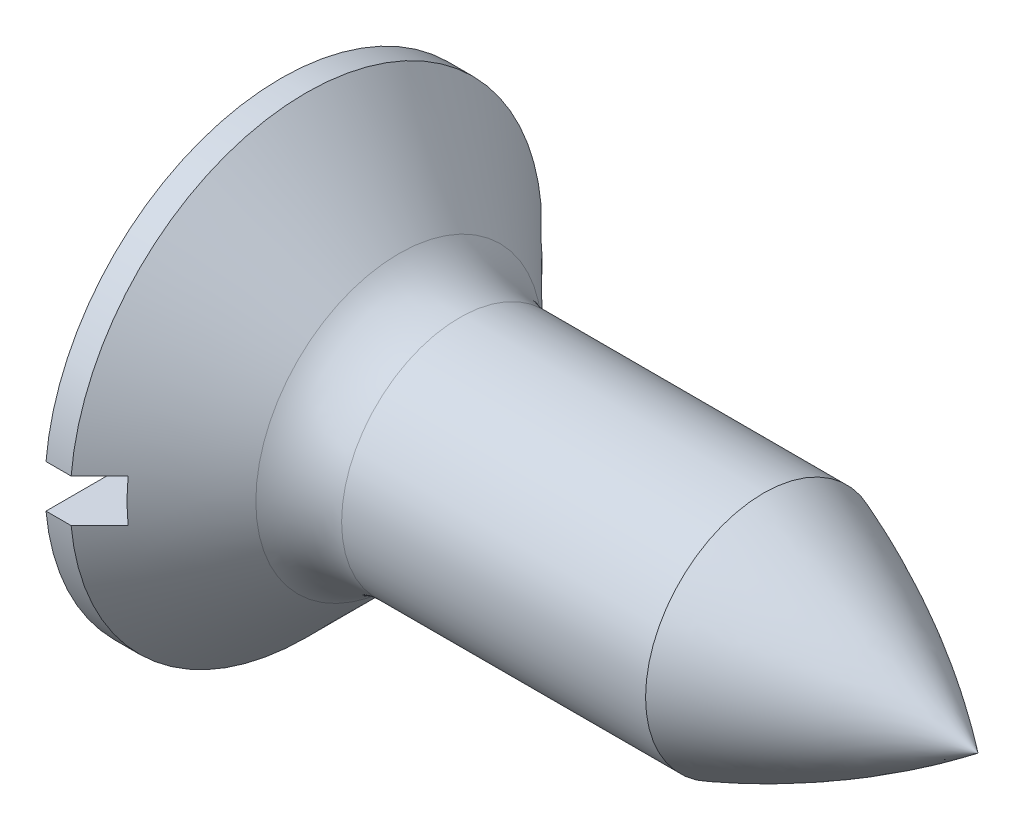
ISO-10303-21;
HEADER;
FILE_DESCRIPTION(('STEP AP214'),'2;1');
FILE_NAME('part.step','',(''),(''),'','','');
FILE_SCHEMA(('AUTOMOTIVE_DESIGN { 1 0 10303 214 1 1 1 1 }'));
ENDSEC;
DATA;
#1=APPLICATION_CONTEXT('core data for automotive mechanical design processes');
#2=APPLICATION_PROTOCOL_DEFINITION('international standard','automotive_design',2000,#1);
#3=PRODUCT_CONTEXT('',#1,'mechanical');
#4=PRODUCT('Part','Part','',(#3));
#5=PRODUCT_RELATED_PRODUCT_CATEGORY('part','',(#4));
#6=PRODUCT_DEFINITION_FORMATION('','',#4);
#7=PRODUCT_DEFINITION_CONTEXT('part definition',#1,'design');
#8=PRODUCT_DEFINITION('design','',#6,#7);
#9=PRODUCT_DEFINITION_SHAPE('','',#8);
#10=(LENGTH_UNIT() NAMED_UNIT(*) SI_UNIT(.MILLI.,.METRE.));
#11=(NAMED_UNIT(*) PLANE_ANGLE_UNIT() SI_UNIT($,.RADIAN.));
#12=(NAMED_UNIT(*) SI_UNIT($,.STERADIAN.) SOLID_ANGLE_UNIT());
#13=UNCERTAINTY_MEASURE_WITH_UNIT(LENGTH_MEASURE(1.E-05),#10,'distance_accuracy_value','');
#14=(GEOMETRIC_REPRESENTATION_CONTEXT(3) GLOBAL_UNCERTAINTY_ASSIGNED_CONTEXT((#13)) GLOBAL_UNIT_ASSIGNED_CONTEXT((#10,
#11,#12)) REPRESENTATION_CONTEXT('',''));
#15=CARTESIAN_POINT('',(0.,0.,0.));
#16=DIRECTION('',(0.,0.,1.));
#17=DIRECTION('',(1.,0.,0.));
#18=AXIS2_PLACEMENT_3D('',#15,#16,#17);
#19=CARTESIAN_POINT('',(-9.69447010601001,0.,0.));
#20=DIRECTION('',(-1.,0.,0.));
#21=DIRECTION('',(0.,0.,1.));
#22=AXIS2_PLACEMENT_3D('',#19,#20,#21);
#23=CYLINDRICAL_SURFACE('',#22,1.1);
#24=CARTESIAN_POINT('',(1.66568542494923,0.,0.));
#25=DIRECTION('',(-1.,0.,0.));
#26=DIRECTION('',(0.,0.,1.));
#27=AXIS2_PLACEMENT_3D('',#24,#25,#26);
#28=CIRCLE('',#27,1.1);
#29=CARTESIAN_POINT('',(1.66568542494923,0.,1.1));
#30=VERTEX_POINT('',#29);
#31=EDGE_CURVE('E143',#30,#30,#28,.T.);
#32=ORIENTED_EDGE('',*,*,#31,.F.);
#33=EDGE_LOOP('',(#32));
#34=FACE_BOUND('',#33,.T.);
#35=CARTESIAN_POINT('',(4.5,0.,0.));
#36=DIRECTION('',(1.,0.,0.));
#37=DIRECTION('',(0.,1.,0.));
#38=AXIS2_PLACEMENT_3D('',#35,#36,#37);
#39=CIRCLE('',#38,1.1);
#40=CARTESIAN_POINT('',(4.5,1.09999999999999,0.));
#41=VERTEX_POINT('',#40);
#42=EDGE_CURVE('E194',#41,#41,#39,.T.);
#43=ORIENTED_EDGE('',*,*,#42,.F.);
#44=EDGE_LOOP('',(#43));
#45=FACE_BOUND('',#44,.T.);
#46=ADVANCED_FACE('F37',(#34,#45),#23,.T.);
#47=CARTESIAN_POINT('',(0.,2.2,0.));
#48=DIRECTION('',(1.,0.,0.));
#49=DIRECTION('',(0.,0.,-1.));
#50=AXIS2_PLACEMENT_3D('',#47,#48,#49);
#51=PLANE('',#50);
#52=CARTESIAN_POINT('',(0.,0.,0.));
#53=DIRECTION('',(-1.,0.,0.));
#54=DIRECTION('',(0.,0.,1.));
#55=AXIS2_PLACEMENT_3D('',#52,#53,#54);
#56=CIRCLE('',#55,2.2);
#57=CARTESIAN_POINT('',(0.,0.2,2.19089023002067));
#58=VERTEX_POINT('',#57);
#59=CARTESIAN_POINT('',(0.,0.2,-2.19089023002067));
#60=VERTEX_POINT('',#59);
#61=EDGE_CURVE('E177',#58,#60,#56,.T.);
#62=ORIENTED_EDGE('',*,*,#61,.T.);
#63=DIRECTION('',(0.,0.,1.));
#64=VECTOR('',#63,1.);
#65=CARTESIAN_POINT('',(0.,0.2,-2.20000000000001));
#66=LINE('',#65,#64);
#67=EDGE_CURVE('E168',#60,#58,#66,.T.);
#68=ORIENTED_EDGE('',*,*,#67,.T.);
#69=EDGE_LOOP('',(#62,#68));
#70=FACE_BOUND('',#69,.T.);
#71=ADVANCED_FACE('F110',(#70),#51,.F.);
#72=CARTESIAN_POINT('',(-9.69447010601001,0.,0.));
#73=DIRECTION('',(-1.,0.,0.));
#74=DIRECTION('',(0.,0.,1.));
#75=AXIS2_PLACEMENT_3D('',#72,#73,#74);
#76=CYLINDRICAL_SURFACE('',#75,2.2);
#77=CARTESIAN_POINT('',(0.234314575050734,0.,0.));
#78=DIRECTION('',(-1.,0.,0.));
#79=DIRECTION('',(0.,0.,1.));
#80=AXIS2_PLACEMENT_3D('',#77,#78,#79);
#81=CIRCLE('',#80,2.20000000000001);
#82=CARTESIAN_POINT('',(0.234314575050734,-0.2,-2.19089023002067));
#83=VERTEX_POINT('',#82);
#84=CARTESIAN_POINT('',(0.234314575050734,-0.2,2.19089023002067));
#85=VERTEX_POINT('',#84);
#86=EDGE_CURVE('E152',#83,#85,#81,.T.);
#87=ORIENTED_EDGE('',*,*,#86,.T.);
#88=DIRECTION('',(-1.,0.,0.));
#89=VECTOR('',#88,1.);
#90=CARTESIAN_POINT('',(-9.69447010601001,-0.200000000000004,2.19089023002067));
#91=LINE('',#90,#89);
#92=CARTESIAN_POINT('',(0.,-0.2,2.19089023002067));
#93=VERTEX_POINT('',#92);
#94=EDGE_CURVE('E59',#85,#93,#91,.T.);
#95=ORIENTED_EDGE('',*,*,#94,.T.);
#96=CARTESIAN_POINT('',(0.,-0.2,-2.19089023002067));
#97=VERTEX_POINT('',#96);
#98=EDGE_CURVE('E162',#97,#93,#56,.T.);
#99=ORIENTED_EDGE('',*,*,#98,.F.);
#100=DIRECTION('',(-1.,0.,0.));
#101=VECTOR('',#100,1.);
#102=CARTESIAN_POINT('',(-9.69447010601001,-0.200000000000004,-2.19089023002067));
#103=LINE('',#102,#101);
#104=EDGE_CURVE('E155',#97,#83,#103,.F.);
#105=ORIENTED_EDGE('',*,*,#104,.T.);
#106=EDGE_LOOP('',(#87,#95,#99,#105));
#107=FACE_BOUND('',#106,.T.);
#108=ADVANCED_FACE('F115',(#107),#76,.T.);
#109=CARTESIAN_POINT('',(1.66568542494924,0.,0.));
#110=DIRECTION('',(-1.,0.,0.));
#111=DIRECTION('',(0.,0.,1.));
#112=AXIS2_PLACEMENT_3D('',#109,#110,#111);
#113=TOROIDAL_SURFACE('',#112,1.9,0.800000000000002);
#114=CARTESIAN_POINT('',(1.1,0.,0.));
#115=DIRECTION('',(-1.,0.,0.));
#116=DIRECTION('',(0.,0.,1.));
#117=AXIS2_PLACEMENT_3D('',#114,#115,#116);
#118=CIRCLE('',#117,1.33431457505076);
#119=CARTESIAN_POINT('',(1.1,0.,1.33431457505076));
#120=VERTEX_POINT('',#119);
#121=EDGE_CURVE('E173',#120,#120,#118,.T.);
#122=ORIENTED_EDGE('',*,*,#121,.F.);
#123=EDGE_LOOP('',(#122));
#124=FACE_BOUND('',#123,.T.);
#125=ORIENTED_EDGE('',*,*,#31,.T.);
#126=EDGE_LOOP('',(#125));
#127=FACE_BOUND('',#126,.T.);
#128=ADVANCED_FACE('F39',(#124,#127),#113,.F.);
#129=ORIENTED_EDGE('',*,*,#98,.T.);
#130=DIRECTION('',(0.,0.,1.));
#131=VECTOR('',#130,1.);
#132=CARTESIAN_POINT('',(0.,-0.2,-2.20000000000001));
#133=LINE('',#132,#131);
#134=EDGE_CURVE('E191',#97,#93,#133,.T.);
#135=ORIENTED_EDGE('',*,*,#134,.F.);
#136=EDGE_LOOP('',(#129,#135));
#137=FACE_BOUND('',#136,.T.);
#138=ADVANCED_FACE('F118',(#137),#51,.F.);
#139=CARTESIAN_POINT('',(0.234314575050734,0.2,2.19089023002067));
#140=VERTEX_POINT('',#139);
#141=CARTESIAN_POINT('',(0.234314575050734,0.2,-2.19089023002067));
#142=VERTEX_POINT('',#141);
#143=EDGE_CURVE('E176',#140,#142,#81,.T.);
#144=ORIENTED_EDGE('',*,*,#143,.T.);
#145=DIRECTION('',(-1.,0.,0.));
#146=VECTOR('',#145,1.);
#147=CARTESIAN_POINT('',(-9.69447010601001,0.200000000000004,-2.19089023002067));
#148=LINE('',#147,#146);
#149=EDGE_CURVE('E163',#142,#60,#148,.T.);
#150=ORIENTED_EDGE('',*,*,#149,.T.);
#151=ORIENTED_EDGE('',*,*,#61,.F.);
#152=DIRECTION('',(-1.,0.,0.));
#153=VECTOR('',#152,1.);
#154=CARTESIAN_POINT('',(-9.69447010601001,0.200000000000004,2.19089023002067));
#155=LINE('',#154,#153);
#156=EDGE_CURVE('E166',#58,#140,#155,.F.);
#157=ORIENTED_EDGE('',*,*,#156,.T.);
#158=EDGE_LOOP('',(#144,#150,#151,#157));
#159=FACE_BOUND('',#158,.T.);
#160=ADVANCED_FACE('F123',(#159),#76,.T.);
#161=CARTESIAN_POINT('',(1.1,0.,0.));
#162=DIRECTION('',(-1.,0.,0.));
#163=DIRECTION('',(0.,0.,1.));
#164=AXIS2_PLACEMENT_3D('',#161,#162,#163);
#165=CONICAL_SURFACE('',#164,1.33431457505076,0.785398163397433);
#166=CARTESIAN_POINT('',(0.500000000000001,0.,0.));
#167=DIRECTION('',(1.,0.,0.));
#168=DIRECTION('',(0.,0.,-1.));
#169=AXIS2_PLACEMENT_3D('',#166,#167,#168);
#170=CIRCLE('',#169,1.93431457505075);
#171=CARTESIAN_POINT('',(0.5,-0.2,-1.92394721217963));
#172=VERTEX_POINT('',#171);
#173=CARTESIAN_POINT('',(0.500000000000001,0.2,-1.92394721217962));
#174=VERTEX_POINT('',#173);
#175=EDGE_CURVE('E52',#172,#174,#170,.T.);
#176=ORIENTED_EDGE('',*,*,#175,.T.);
#177=CARTESIAN_POINT('',(-2.41069391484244,0.200000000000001,4.84087877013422));
#178=CARTESIAN_POINT('',(-2.24297367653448,0.200000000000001,4.67301429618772));
#179=CARTESIAN_POINT('',(-2.07525978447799,0.200000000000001,4.50514348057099));
#180=CARTESIAN_POINT('',(-1.73985244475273,0.200000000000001,4.16938038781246));
#181=CARTESIAN_POINT('',(-1.57215899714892,0.200000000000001,4.00148811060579));
#182=CARTESIAN_POINT('',(-1.23678930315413,0.2,3.66566230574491));
#183=CARTESIAN_POINT('',(-1.0691130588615,0.2,3.49772877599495));
#184=CARTESIAN_POINT('',(-0.733805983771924,0.2,3.16181740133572));
#185=CARTESIAN_POINT('',(-0.566175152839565,0.2,2.99383955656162));
#186=CARTESIAN_POINT('',(-0.232103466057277,0.2,2.6589335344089));
#187=CARTESIAN_POINT('',(-0.065662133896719,0.2,2.49200583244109));
#188=CARTESIAN_POINT('',(0.267092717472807,0.2,2.1580202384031));
#189=CARTESIAN_POINT('',(0.433406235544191,0.2,1.99096234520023));
#190=CARTESIAN_POINT('',(0.765782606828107,0.2,1.65661111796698));
#191=CARTESIAN_POINT('',(0.931845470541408,0.199999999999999,1.48931779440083));
#192=CARTESIAN_POINT('',(1.1804372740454,0.199999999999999,1.23788329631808));
#193=CARTESIAN_POINT('',(1.26321686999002,0.199999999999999,1.15398997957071));
#194=CARTESIAN_POINT('',(1.42846267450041,0.199999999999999,0.985895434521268));
#195=CARTESIAN_POINT('',(1.51092888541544,0.199999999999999,0.901694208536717));
#196=CARTESIAN_POINT('',(1.61557294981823,0.199999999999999,0.793956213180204));
#197=CARTESIAN_POINT('',(1.63807561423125,0.199999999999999,0.770735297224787));
#198=CARTESIAN_POINT('',(1.68300748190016,0.199999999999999,0.724222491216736));
#199=CARTESIAN_POINT('',(1.70543668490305,0.199999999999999,0.700930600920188));
#200=CARTESIAN_POINT('',(1.77263186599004,0.199999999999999,0.630875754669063));
#201=CARTESIAN_POINT('',(1.81726039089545,0.199999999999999,0.583979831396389));
#202=CARTESIAN_POINT('',(1.89116538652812,0.199999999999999,0.505104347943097));
#203=CARTESIAN_POINT('',(1.92064383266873,0.199999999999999,0.473314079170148));
#204=CARTESIAN_POINT('',(1.9789835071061,0.199999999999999,0.409275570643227));
#205=CARTESIAN_POINT('',(2.00784580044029,0.199999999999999,0.377028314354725));
#206=CARTESIAN_POINT('',(2.05455425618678,0.199999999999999,0.323001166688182));
#207=CARTESIAN_POINT('',(2.0727247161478,0.199999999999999,0.301502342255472));
#208=CARTESIAN_POINT('',(2.10835670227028,0.199999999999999,0.257713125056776));
#209=CARTESIAN_POINT('',(2.12581381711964,0.199999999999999,0.235419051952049));
#210=CARTESIAN_POINT('',(2.15091417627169,0.199999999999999,0.200941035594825));
#211=CARTESIAN_POINT('',(2.15915158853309,0.199999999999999,0.189193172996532));
#212=CARTESIAN_POINT('',(2.17500740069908,0.199999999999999,0.165290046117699));
#213=CARTESIAN_POINT('',(2.18262612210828,0.199999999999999,0.153134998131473));
#214=CARTESIAN_POINT('',(2.19687665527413,0.199999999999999,0.128369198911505));
#215=CARTESIAN_POINT('',(2.20351543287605,0.199999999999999,0.115762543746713));
#216=CARTESIAN_POINT('',(2.21533974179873,0.199999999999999,0.0898989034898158));
#217=CARTESIAN_POINT('',(2.22052901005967,0.199999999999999,0.0766436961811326));
#218=CARTESIAN_POINT('',(2.22857314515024,0.199999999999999,0.0498599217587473));
#219=CARTESIAN_POINT('',(2.23149676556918,0.199999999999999,0.0363533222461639));
#220=CARTESIAN_POINT('',(2.23456247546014,0.199999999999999,0.00906199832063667));
#221=CARTESIAN_POINT('',(2.23471669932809,0.199999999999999,-0.00472124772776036));
#222=CARTESIAN_POINT('',(2.23223406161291,0.199999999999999,-0.0319600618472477));
#223=CARTESIAN_POINT('',(2.2296076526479,0.199999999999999,-0.0454166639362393));
#224=CARTESIAN_POINT('',(2.22220860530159,0.199999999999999,-0.0717712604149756));
#225=CARTESIAN_POINT('',(2.21742331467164,0.199999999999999,-0.0846654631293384));
#226=CARTESIAN_POINT('',(2.2040995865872,0.199999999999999,-0.115155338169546));
#227=CARTESIAN_POINT('',(2.19483042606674,0.199999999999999,-0.132419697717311));
#228=CARTESIAN_POINT('',(2.17472772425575,0.199999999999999,-0.166029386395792));
#229=CARTESIAN_POINT('',(2.16388972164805,0.199999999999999,-0.182371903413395));
#230=CARTESIAN_POINT('',(2.1412388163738,0.199999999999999,-0.214532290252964));
#231=CARTESIAN_POINT('',(2.12941957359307,0.199999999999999,-0.230345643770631));
#232=CARTESIAN_POINT('',(2.10523785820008,0.199999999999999,-0.261508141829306));
#233=CARTESIAN_POINT('',(2.09287621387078,0.199999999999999,-0.276857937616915));
#234=CARTESIAN_POINT('',(2.0505986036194,0.199999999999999,-0.328119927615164));
#235=CARTESIAN_POINT('',(2.0198647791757,0.199999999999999,-0.36335306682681));
#236=CARTESIAN_POINT('',(1.95754414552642,0.199999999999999,-0.433059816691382));
#237=CARTESIAN_POINT('',(1.92595704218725,0.199999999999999,-0.467533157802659));
#238=CARTESIAN_POINT('',(1.86227482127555,0.199999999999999,-0.536089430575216));
#239=CARTESIAN_POINT('',(1.8301791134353,0.199999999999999,-0.570171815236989));
#240=CARTESIAN_POINT('',(1.76571827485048,0.199999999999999,-0.638069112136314));
#241=CARTESIAN_POINT('',(1.73335318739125,0.199999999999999,-0.671884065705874));
#242=CARTESIAN_POINT('',(1.63636170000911,0.199999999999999,-0.772703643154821));
#243=CARTESIAN_POINT('',(1.57148068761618,0.199999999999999,-0.839463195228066));
#244=CARTESIAN_POINT('',(1.44143653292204,0.199999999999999,-0.972625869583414));
#245=CARTESIAN_POINT('',(1.37627358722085,0.199999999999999,-1.03902918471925));
#246=CARTESIAN_POINT('',(1.18057171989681,0.199999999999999,-1.23792102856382));
#247=CARTESIAN_POINT('',(1.04976585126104,0.199999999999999,-1.37014684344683));
#248=CARTESIAN_POINT('',(0.787879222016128,0.2,-1.63432723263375));
#249=CARTESIAN_POINT('',(0.656798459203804,0.2,-1.76628180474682));
#250=CARTESIAN_POINT('',(0.394458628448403,0.2,-2.03007558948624));
#251=CARTESIAN_POINT('',(0.263199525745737,0.2,-2.16191476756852));
#252=CARTESIAN_POINT('',(0.000598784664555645,0.2,-2.42551011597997));
#253=CARTESIAN_POINT('',(-0.130742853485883,0.2,-2.55726628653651));
#254=CARTESIAN_POINT('',(-0.525221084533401,0.2,-2.95283660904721));
#255=CARTESIAN_POINT('',(-0.788434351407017,0.2,-3.21657430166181));
#256=CARTESIAN_POINT('',(-1.3149382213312,0.2,-3.74394349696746));
#257=CARTESIAN_POINT('',(-1.57822881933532,0.200000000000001,-4.00757500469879));
#258=CARTESIAN_POINT('',(-1.93641850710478,0.200000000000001,-4.36615701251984));
#259=CARTESIAN_POINT('',(-2.03129473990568,0.200000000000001,-4.46113034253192));
#260=CARTESIAN_POINT('',(-2.22101118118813,0.200000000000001,-4.65102947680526));
#261=CARTESIAN_POINT('',(-2.31585138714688,0.200000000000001,-4.74595528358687));
#262=CARTESIAN_POINT('',(-2.41069391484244,0.200000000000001,-4.84087877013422));
#263=B_SPLINE_CURVE_WITH_KNOTS('',3,(#177,#178,#179,#180,#181,#182,#183,#184,#185,#186,#187,
#188,#189,#190,#191,#192,#193,#194,#195,#196,#197,#198,#199,#200,#201,#202,#203,#204,#205,#206,
#207,#208,#209,#210,#211,#212,#213,#214,#215,#216,#217,#218,#219,#220,#221,#222,#223,#224,#225,
#226,#227,#228,#229,#230,#231,#232,#233,#234,#235,#236,#237,#238,#239,#240,#241,#242,#243,#244,
#245,#246,#247,#248,#249,#250,#251,#252,#253,#254,#255,#256,#257,#258,#259,#260,#261,#262),
.UNSPECIFIED.,.F.,.F.,(4,2,2,2,2,2,2,2,2,2,2,2,2,2,2,2,2,2,2,2,2,2,2,2,2,2,2,2,2,2,2,2,2,2,2,2,
2,2,2,2,2,2,4),(0.,0.71188274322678,1.42376769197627,2.13570373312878,2.8476376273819,
3.55482080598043,4.26201020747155,4.96916911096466,5.32274350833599,5.6763152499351,
5.77332138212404,5.87032784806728,6.06453433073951,6.19459549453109,6.32440986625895,
6.40884980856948,6.49375068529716,6.53678240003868,6.57979160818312,6.62247861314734,
6.66505453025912,6.70628147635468,6.74732773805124,6.78822024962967,6.8293555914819,
6.88797622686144,6.94676696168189,7.00597258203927,7.06509074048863,7.20530929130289,
7.34557680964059,7.48602116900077,7.62644338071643,7.90572040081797,8.18482678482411,
8.74280766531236,9.30079303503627,9.85890999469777,10.4170254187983,11.534857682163,
12.6526284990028,13.0553602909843,13.457914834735),.UNSPECIFIED.);
#264=EDGE_CURVE('E11',#174,#142,#263,.T.);
#265=ORIENTED_EDGE('',*,*,#264,.T.);
#266=ORIENTED_EDGE('',*,*,#143,.F.);
#267=CARTESIAN_POINT('',(0.500000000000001,0.2,1.92394721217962));
#268=VERTEX_POINT('',#267);
#269=EDGE_CURVE('E41',#140,#268,#263,.T.);
#270=ORIENTED_EDGE('',*,*,#269,.T.);
#271=CARTESIAN_POINT('',(0.5,-0.2,1.92394721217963));
#272=VERTEX_POINT('',#271);
#273=EDGE_CURVE('E142',#268,#272,#170,.T.);
#274=ORIENTED_EDGE('',*,*,#273,.T.);
#275=CARTESIAN_POINT('',(-2.41069391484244,-0.200000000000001,-4.84087877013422));
#276=CARTESIAN_POINT('',(-2.24297367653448,-0.200000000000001,-4.67301429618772));
#277=CARTESIAN_POINT('',(-2.07525978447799,-0.200000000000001,-4.50514348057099));
#278=CARTESIAN_POINT('',(-1.73985244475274,-0.200000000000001,-4.16938038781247));
#279=CARTESIAN_POINT('',(-1.57215899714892,-0.200000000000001,-4.00148811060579));
#280=CARTESIAN_POINT('',(-1.23678930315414,-0.200000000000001,-3.66566230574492));
#281=CARTESIAN_POINT('',(-1.0691130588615,-0.200000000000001,-3.49772877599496));
#282=CARTESIAN_POINT('',(-0.733805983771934,-0.2,-3.16181740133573));
#283=CARTESIAN_POINT('',(-0.566175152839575,-0.2,-2.99383955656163));
#284=CARTESIAN_POINT('',(-0.232103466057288,-0.2,-2.65893353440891));
#285=CARTESIAN_POINT('',(-0.0656621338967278,-0.2,-2.4920058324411));
#286=CARTESIAN_POINT('',(0.2670927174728,-0.2,-2.15802023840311));
#287=CARTESIAN_POINT('',(0.433406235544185,-0.2,-1.99096234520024));
#288=CARTESIAN_POINT('',(0.765782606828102,-0.2,-1.65661111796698));
#289=CARTESIAN_POINT('',(0.931845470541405,-0.2,-1.48931779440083));
#290=CARTESIAN_POINT('',(1.1804372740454,-0.2,-1.23788329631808));
#291=CARTESIAN_POINT('',(1.26321686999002,-0.2,-1.15398997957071));
#292=CARTESIAN_POINT('',(1.42846267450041,-0.199999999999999,-0.98589543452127));
#293=CARTESIAN_POINT('',(1.51092888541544,-0.199999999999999,-0.901694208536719));
#294=CARTESIAN_POINT('',(1.61557294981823,-0.199999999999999,-0.793956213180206));
#295=CARTESIAN_POINT('',(1.63807561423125,-0.199999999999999,-0.770735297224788));
#296=CARTESIAN_POINT('',(1.68300748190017,-0.199999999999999,-0.724222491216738));
#297=CARTESIAN_POINT('',(1.70543668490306,-0.199999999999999,-0.700930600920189));
#298=CARTESIAN_POINT('',(1.77263186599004,-0.199999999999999,-0.630875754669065));
#299=CARTESIAN_POINT('',(1.81726039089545,-0.199999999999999,-0.583979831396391));
#300=CARTESIAN_POINT('',(1.89116538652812,-0.199999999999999,-0.505104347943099));
#301=CARTESIAN_POINT('',(1.92064383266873,-0.199999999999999,-0.47331407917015));
#302=CARTESIAN_POINT('',(1.9789835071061,-0.199999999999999,-0.409275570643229));
#303=CARTESIAN_POINT('',(2.00784580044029,-0.199999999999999,-0.377028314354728));
#304=CARTESIAN_POINT('',(2.05455425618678,-0.199999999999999,-0.323001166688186));
#305=CARTESIAN_POINT('',(2.0727247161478,-0.199999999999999,-0.301502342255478));
#306=CARTESIAN_POINT('',(2.10835670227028,-0.199999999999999,-0.257713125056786));
#307=CARTESIAN_POINT('',(2.12581381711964,-0.199999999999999,-0.23541905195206));
#308=CARTESIAN_POINT('',(2.15091417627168,-0.199999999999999,-0.200941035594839));
#309=CARTESIAN_POINT('',(2.15915158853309,-0.199999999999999,-0.189193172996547));
#310=CARTESIAN_POINT('',(2.17500740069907,-0.199999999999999,-0.165290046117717));
#311=CARTESIAN_POINT('',(2.18262612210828,-0.199999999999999,-0.153134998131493));
#312=CARTESIAN_POINT('',(2.19687665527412,-0.199999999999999,-0.128369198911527));
#313=CARTESIAN_POINT('',(2.20351543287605,-0.199999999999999,-0.115762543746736));
#314=CARTESIAN_POINT('',(2.21533974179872,-0.199999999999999,-0.0898989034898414));
#315=CARTESIAN_POINT('',(2.22052901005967,-0.199999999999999,-0.0766436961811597));
#316=CARTESIAN_POINT('',(2.22857314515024,-0.199999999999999,-0.049859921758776));
#317=CARTESIAN_POINT('',(2.23149676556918,-0.199999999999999,-0.0363533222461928));
#318=CARTESIAN_POINT('',(2.23456247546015,-0.199999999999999,-0.0090619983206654));
#319=CARTESIAN_POINT('',(2.2347166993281,-0.199999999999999,0.00472124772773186));
#320=CARTESIAN_POINT('',(2.23223406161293,-0.199999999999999,0.03196006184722));
#321=CARTESIAN_POINT('',(2.22960765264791,-0.199999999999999,0.0454166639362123));
#322=CARTESIAN_POINT('',(2.22220860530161,-0.199999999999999,0.0717712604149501));
#323=CARTESIAN_POINT('',(2.21742331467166,-0.199999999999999,0.0846654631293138));
#324=CARTESIAN_POINT('',(2.20409958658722,-0.199999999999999,0.115155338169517));
#325=CARTESIAN_POINT('',(2.19483042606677,-0.199999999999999,0.132419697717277));
#326=CARTESIAN_POINT('',(2.17472772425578,-0.199999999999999,0.166029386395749));
#327=CARTESIAN_POINT('',(2.16388972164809,-0.199999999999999,0.182371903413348));
#328=CARTESIAN_POINT('',(2.14123881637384,-0.199999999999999,0.214532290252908));
#329=CARTESIAN_POINT('',(2.12941957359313,-0.199999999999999,0.23034564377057));
#330=CARTESIAN_POINT('',(2.10523785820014,-0.199999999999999,0.261508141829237));
#331=CARTESIAN_POINT('',(2.09287621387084,-0.199999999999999,0.276857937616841));
#332=CARTESIAN_POINT('',(2.05059860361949,-0.199999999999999,0.328119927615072));
#333=CARTESIAN_POINT('',(2.0198647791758,-0.199999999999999,0.363353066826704));
#334=CARTESIAN_POINT('',(1.95754414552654,-0.199999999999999,0.433059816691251));
#335=CARTESIAN_POINT('',(1.92595704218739,-0.199999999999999,0.467533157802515));
#336=CARTESIAN_POINT('',(1.86227482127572,-0.199999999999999,0.536089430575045));
#337=CARTESIAN_POINT('',(1.83017911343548,-0.199999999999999,0.570171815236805));
#338=CARTESIAN_POINT('',(1.76571827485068,-0.199999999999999,0.638069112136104));
#339=CARTESIAN_POINT('',(1.73335318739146,-0.199999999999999,0.671884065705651));
#340=CARTESIAN_POINT('',(1.63636170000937,-0.199999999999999,0.77270364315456));
#341=CARTESIAN_POINT('',(1.57148068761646,-0.199999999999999,0.839463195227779));
#342=CARTESIAN_POINT('',(1.44143653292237,-0.199999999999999,0.972625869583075));
#343=CARTESIAN_POINT('',(1.37627358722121,-0.199999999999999,1.03902918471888));
#344=CARTESIAN_POINT('',(1.18057171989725,-0.2,1.23792102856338));
#345=CARTESIAN_POINT('',(1.04976585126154,-0.2,1.37014684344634));
#346=CARTESIAN_POINT('',(0.787879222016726,-0.2,1.63432723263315));
#347=CARTESIAN_POINT('',(0.656798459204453,-0.2,1.76628180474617));
#348=CARTESIAN_POINT('',(0.394458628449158,-0.2,2.03007558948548));
#349=CARTESIAN_POINT('',(0.263199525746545,-0.2,2.16191476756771));
#350=CARTESIAN_POINT('',(0.000598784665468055,-0.2,2.42551011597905));
#351=CARTESIAN_POINT('',(-0.130742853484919,-0.2,2.55726628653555));
#352=CARTESIAN_POINT('',(-0.525221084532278,-0.2,2.95283660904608));
#353=CARTESIAN_POINT('',(-0.788434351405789,-0.2,3.21657430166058));
#354=CARTESIAN_POINT('',(-1.31493822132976,-0.200000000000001,3.74394349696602));
#355=CARTESIAN_POINT('',(-1.57822881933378,-0.200000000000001,4.00757500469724));
#356=CARTESIAN_POINT('',(-1.9364185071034,-0.200000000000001,4.36615701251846));
#357=CARTESIAN_POINT('',(-2.03129473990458,-0.200000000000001,4.46113034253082));
#358=CARTESIAN_POINT('',(-2.22101118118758,-0.200000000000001,4.65102947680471));
#359=CARTESIAN_POINT('',(-2.31585138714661,-0.200000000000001,4.7459552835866));
#360=CARTESIAN_POINT('',(-2.41069391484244,-0.200000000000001,4.84087877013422));
#361=B_SPLINE_CURVE_WITH_KNOTS('',3,(#275,#276,#277,#278,#279,#280,#281,#282,#283,#284,#285,
#286,#287,#288,#289,#290,#291,#292,#293,#294,#295,#296,#297,#298,#299,#300,#301,#302,#303,#304,
#305,#306,#307,#308,#309,#310,#311,#312,#313,#314,#315,#316,#317,#318,#319,#320,#321,#322,#323,
#324,#325,#326,#327,#328,#329,#330,#331,#332,#333,#334,#335,#336,#337,#338,#339,#340,#341,#342,
#343,#344,#345,#346,#347,#348,#349,#350,#351,#352,#353,#354,#355,#356,#357,#358,#359,#360),
.UNSPECIFIED.,.F.,.F.,(4,2,2,2,2,2,2,2,2,2,2,2,2,2,2,2,2,2,2,2,2,2,2,2,2,2,2,2,2,2,2,2,2,2,2,2,
2,2,2,2,2,2,4),(0.,0.711882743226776,1.42376769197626,2.13570373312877,2.84763762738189,
3.55482080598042,4.26201020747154,4.96916911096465,5.32274350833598,5.6763152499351,
5.77332138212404,5.87032784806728,6.06453433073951,6.19459549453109,6.32440986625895,
6.40884980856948,6.49375068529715,6.53678240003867,6.5797916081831,6.62247861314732,
6.6650545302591,6.70628147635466,6.74732773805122,6.78822024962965,6.82935559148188,
6.8879762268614,6.94676696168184,7.0059725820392,7.06509074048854,7.20530929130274,
7.34557680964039,7.48602116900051,7.62644338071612,7.90572040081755,8.18482678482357,
8.7428076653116,9.30079303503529,9.85890999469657,10.4170254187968,11.5348576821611,
12.6526284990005,13.0553602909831,13.457914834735),.UNSPECIFIED.);
#362=EDGE_CURVE('E136',#272,#85,#361,.T.);
#363=ORIENTED_EDGE('',*,*,#362,.T.);
#364=ORIENTED_EDGE('',*,*,#86,.F.);
#365=EDGE_CURVE('E144',#83,#172,#361,.T.);
#366=ORIENTED_EDGE('',*,*,#365,.T.);
#367=EDGE_LOOP('',(#176,#265,#266,#270,#274,#363,#364,#366));
#368=FACE_BOUND('',#367,.T.);
#369=ORIENTED_EDGE('',*,*,#121,.T.);
#370=EDGE_LOOP('',(#369));
#371=FACE_BOUND('',#370,.T.);
#372=ADVANCED_FACE('F126',(#368,#371),#165,.T.);
#373=CARTESIAN_POINT('',(0.,0.2,-2.20000000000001));
#374=DIRECTION('',(0.,1.,0.));
#375=DIRECTION('',(-1.,0.,0.));
#376=AXIS2_PLACEMENT_3D('',#373,#374,#375);
#377=PLANE('',#376);
#378=ORIENTED_EDGE('',*,*,#67,.F.);
#379=ORIENTED_EDGE('',*,*,#149,.F.);
#380=ORIENTED_EDGE('',*,*,#264,.F.);
#381=DIRECTION('',(0.,0.,1.));
#382=VECTOR('',#381,1.);
#383=CARTESIAN_POINT('',(0.5,0.2,-2.20000000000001));
#384=LINE('',#383,#382);
#385=EDGE_CURVE('E186',#174,#268,#384,.T.);
#386=ORIENTED_EDGE('',*,*,#385,.T.);
#387=ORIENTED_EDGE('',*,*,#269,.F.);
#388=ORIENTED_EDGE('',*,*,#156,.F.);
#389=EDGE_LOOP('',(#378,#379,#380,#386,#387,#388));
#390=FACE_BOUND('',#389,.T.);
#391=ADVANCED_FACE('F130',(#390),#377,.F.);
#392=CARTESIAN_POINT('',(0.5,0.2,-2.20000000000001));
#393=DIRECTION('',(1.,0.,0.));
#394=DIRECTION('',(0.,0.,-1.));
#395=AXIS2_PLACEMENT_3D('',#392,#393,#394);
#396=PLANE('',#395);
#397=ORIENTED_EDGE('',*,*,#385,.F.);
#398=ORIENTED_EDGE('',*,*,#175,.F.);
#399=DIRECTION('',(0.,0.,1.));
#400=VECTOR('',#399,1.);
#401=CARTESIAN_POINT('',(0.5,-0.2,-2.20000000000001));
#402=LINE('',#401,#400);
#403=EDGE_CURVE('E158',#172,#272,#402,.T.);
#404=ORIENTED_EDGE('',*,*,#403,.T.);
#405=ORIENTED_EDGE('',*,*,#273,.F.);
#406=EDGE_LOOP('',(#397,#398,#404,#405));
#407=FACE_BOUND('',#406,.T.);
#408=ADVANCED_FACE('F106',(#407),#396,.F.);
#409=CARTESIAN_POINT('',(0.,-0.2,-2.20000000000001));
#410=DIRECTION('',(0.,-1.,0.));
#411=DIRECTION('',(1.,0.,0.));
#412=AXIS2_PLACEMENT_3D('',#409,#410,#411);
#413=PLANE('',#412);
#414=ORIENTED_EDGE('',*,*,#134,.T.);
#415=ORIENTED_EDGE('',*,*,#94,.F.);
#416=ORIENTED_EDGE('',*,*,#362,.F.);
#417=ORIENTED_EDGE('',*,*,#403,.F.);
#418=ORIENTED_EDGE('',*,*,#365,.F.);
#419=ORIENTED_EDGE('',*,*,#104,.F.);
#420=EDGE_LOOP('',(#414,#415,#416,#417,#418,#419));
#421=FACE_BOUND('',#420,.T.);
#422=ADVANCED_FACE('F100',(#421),#413,.F.);
#423=CARTESIAN_POINT('',(1.68408286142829,-6.38803116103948,0.));
#424=DIRECTION('',(0.,0.,-1.));
#425=DIRECTION('',(0.,1.,0.));
#426=AXIS2_PLACEMENT_3D('',#423,#424,#425);
#427=CIRCLE('',#426,8.);
#428=TRIMMED_CURVE('',#427,(PARAMETER_VALUE(-0.645990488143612)),
(PARAMETER_VALUE(0.645990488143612)),.T.,.PARAMETER.);
#429=CARTESIAN_POINT('',(1.68408286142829,0.,0.));
#430=DIRECTION('',(1.,0.,0.));
#431=AXIS1_PLACEMENT('',#429,#430);
#432=SURFACE_OF_REVOLUTION('',#428,#431);
#433=ORIENTED_EDGE('',*,*,#42,.T.);
#434=EDGE_LOOP('',(#433));
#435=FACE_BOUND('',#434,.T.);
#436=CARTESIAN_POINT('',(6.5,0.,0.));
#437=VERTEX_POINT('',#436);
#438=VERTEX_LOOP('',#437);
#439=FACE_BOUND('',#438,.T.);
#440=ADVANCED_FACE('F98',(#435,#439),#432,.T.);
#441=CLOSED_SHELL('',(#46,#71,#108,#128,#138,#160,#372,#391,#408,#422,#440));
#442=MANIFOLD_SOLID_BREP('B2',#441);
#443=ADVANCED_BREP_SHAPE_REPRESENTATION('',(#18,#442),#14);
#444=SHAPE_DEFINITION_REPRESENTATION(#9,#443);
ENDSEC;
END-ISO-10303-21;
